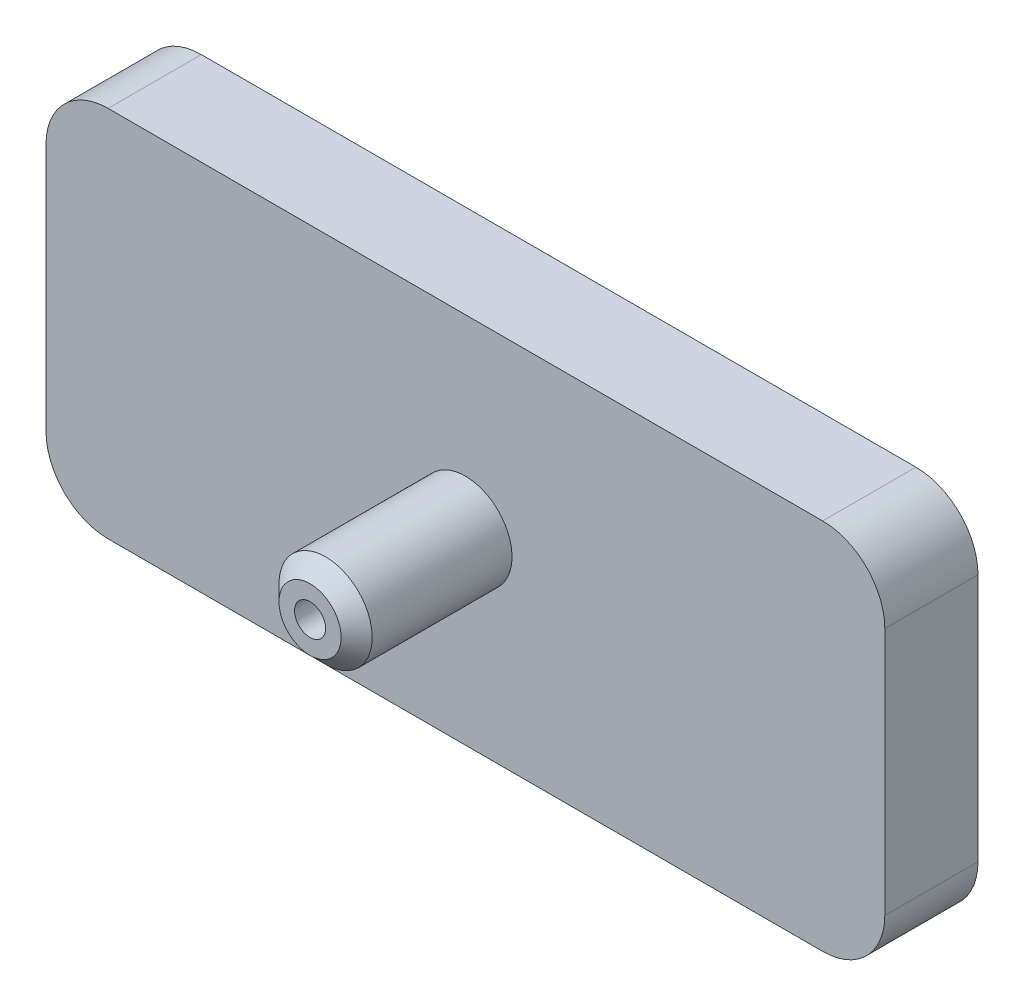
from build123d import *

# Parameters (mm, degrees)
ESQUISSE4_R             = 1
BOSS_EXTRU_3_DEPTH      = 3
ENL_V_MAT_EXTRU_2_DEPTH = 2


with BuildPart() as part:
    # Esquisse4 → Boss.-Extru.3 (new body)
    with BuildSketch(Plane.XY):
        with BuildLine():
            Line((-11.5, -6), (11.5, -6))
            ThreePointArc((11.5, -6), (12.914213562, -5.414213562), (13.5, -4))
            Line((13.5, -4), (13.5, 4))
            ThreePointArc((13.5, 4), (12.914213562, 5.414213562), (11.5, 6))
            Line((11.5, 6), (-11.5, 6))
            ThreePointArc((-11.5, 6), (-12.914213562, 5.414213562), (-13.5, 4))
            Line((-13.5, 4), (-13.5, -4))
            ThreePointArc((-13.5, -4), (-12.914213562, -5.414213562), (-11.5, -6))
        make_face()
        Circle(ESQUISSE4_R, mode=Mode.SUBTRACT)
    extrude(amount=BOSS_EXTRU_3_DEPTH)

    # Esquisse5 → Enl_v. mat.-Extru.2 (cut)
    with BuildSketch(Plane(origin=(0, 0, 0), x_dir=(-1, 0, 0), z_dir=(0, 0, -1))):
        with BuildLine():
            Line((-11.5, -5), (11.5, -5))
            ThreePointArc((11.5, -5), (12.207106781, -4.707106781), (12.5, -4))
            Line((12.5, -4), (12.5, 4))
            ThreePointArc((12.5, 4), (12.207106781, 4.707106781), (11.5, 5))
            Line((11.5, 5), (-11.5, 5))
            ThreePointArc((-11.5, 5), (-12.207106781, 4.707106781), (-12.5, 4))
            Line((-12.5, 4), (-12.5, -4))
            ThreePointArc((-12.5, -4), (-12.207106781, -4.707106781), (-11.5, -5))
        make_face()
    extrude(amount=-ENL_V_MAT_EXTRU_2_DEPTH, mode=Mode.SUBTRACT)

    # Esquisse6 → R_volution1 (revolve)
    with BuildSketch(Plane(origin=(0, 0, 0), x_dir=(0, 0, -1), z_dir=(1, 0, 0)), mode=Mode.PRIVATE) as r_volution1_sk:
        Polygon((-3, 0.5), (-8, 0.5), (-8, 1), (-7.5, 1.5), (-3, 1.5), align=None)
    revolve(r_volution1_sk.sketch.rotate(Axis((0, 0, 0), (0, 0, 1)), 90), axis=Axis((0, 0, 0), (0, 0, 1)))


solid = part.part
